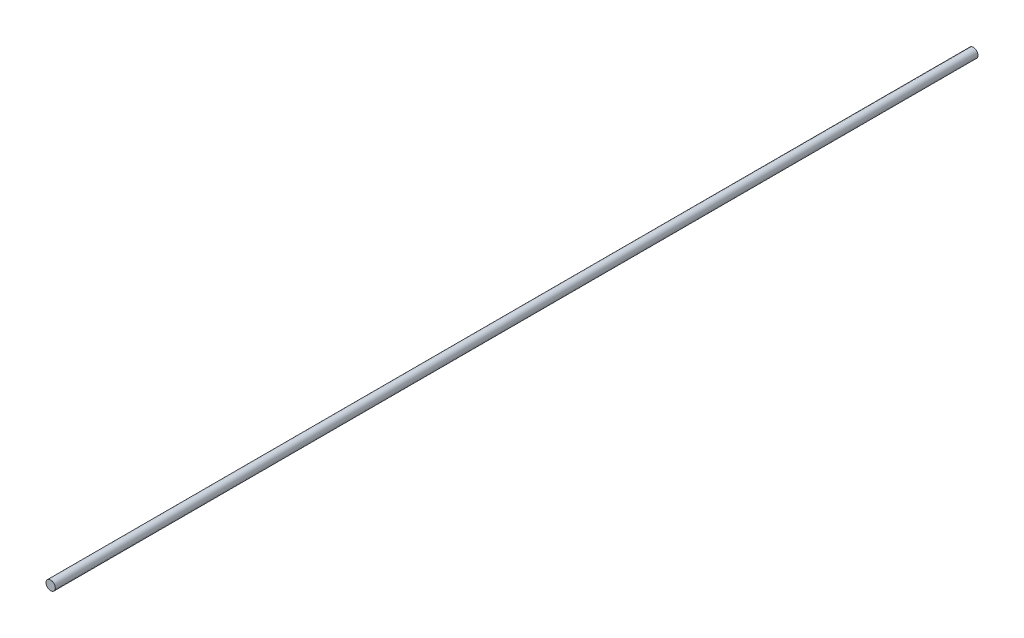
from build123d import *

# Parameters (mm, degrees)
SKETCH1_R           = 30
BOSS_EXTRUDE1_DEPTH = 5950


with BuildPart() as part:
    # Sketch1 → Boss-Extrude1 (new body)
    with BuildSketch(Plane.XY):
        Circle(SKETCH1_R)
    extrude(amount=-BOSS_EXTRUDE1_DEPTH)


solid = part.part
